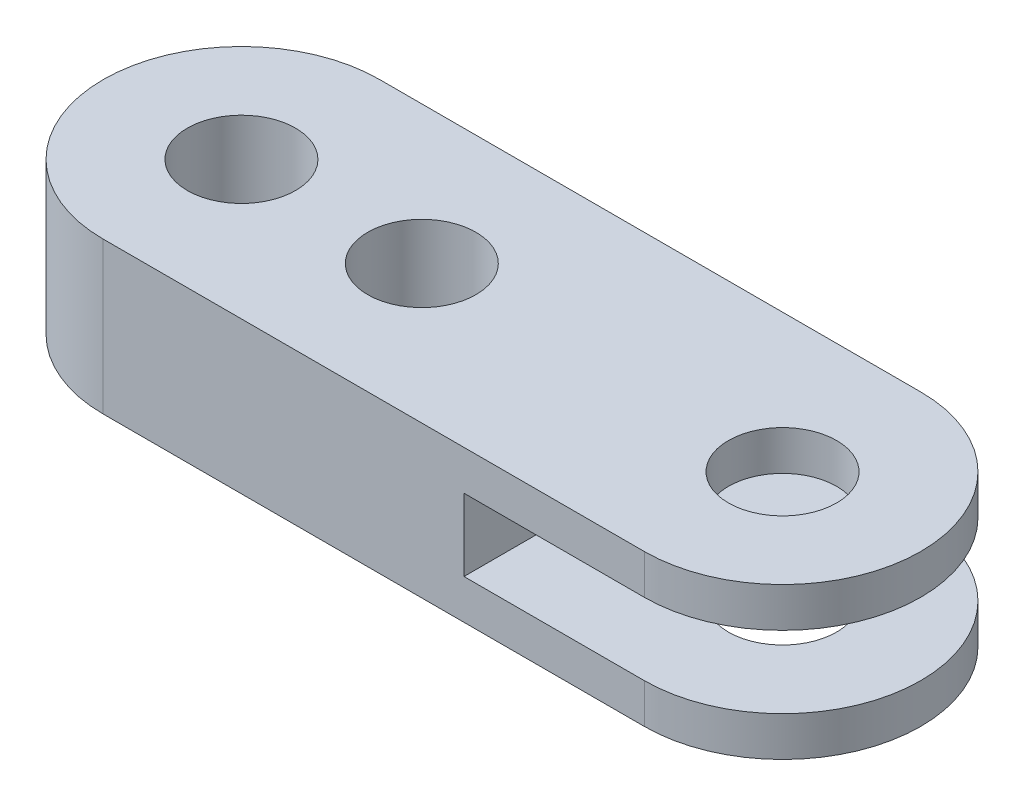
from build123d import *

# Parameters (mm, degrees)
SKETCH1_R           = 1.5
BOSS_EXTRUDE1_DEPTH = 4.2
CUT_EXTRUDE1_REACH  = 18.36
SKETCH3_W           = 7.662243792
SKETCH3_H           = 2


with BuildPart() as part:
    # Sketch1 → Boss-Extrude1 (new body)
    with BuildSketch(Plane(origin=(0, 0, 0), x_dir=(1, 0, 0), z_dir=(0, 1, 0))):
        with BuildLine():
            Line((0, 0), (15, 0))
            ThreePointArc((15, 0), (18.831121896, 3.831121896), (15, 7.662243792))
            Line((15, 7.662243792), (0, 7.662243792))
            ThreePointArc((0, 7.662243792), (-3.831121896, 3.831121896), (0, 0))
        make_face()
        with Locations(Location((15, 3.831121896, 0), (0, 0, 270))):
            Circle(SKETCH1_R, mode=Mode.SUBTRACT)
        with Locations(Location((5, 3.831121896, 0), (0, 0, 270))):
            Circle(SKETCH1_R, mode=Mode.SUBTRACT)
        with Locations(Location((0, 3.831121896, 0), (0, 0, 270))):
            Circle(SKETCH1_R, mode=Mode.SUBTRACT)
    extrude(amount=BOSS_EXTRUDE1_DEPTH)

    # Sketch3 → Cut-Extrude1 (cut, up to next)
    with BuildSketch(Plane(origin=(10, 0, 0), x_dir=(0, 0, -1), z_dir=(1, 0, 0)), mode=Mode.PRIVATE) as cut_extrude1_sk1:
        with Locations((3.831121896, 2.1)):
            Rectangle(SKETCH3_W, SKETCH3_H)
    cut_extrude1_tool1 = extrude(cut_extrude1_sk1.sketch, amount=CUT_EXTRUDE1_REACH, mode=Mode.PRIVATE) & part.part
    add(cut_extrude1_tool1.solids().sort_by_distance((10, 2.1, -3.831122))[0], mode=Mode.SUBTRACT)


solid = part.part
